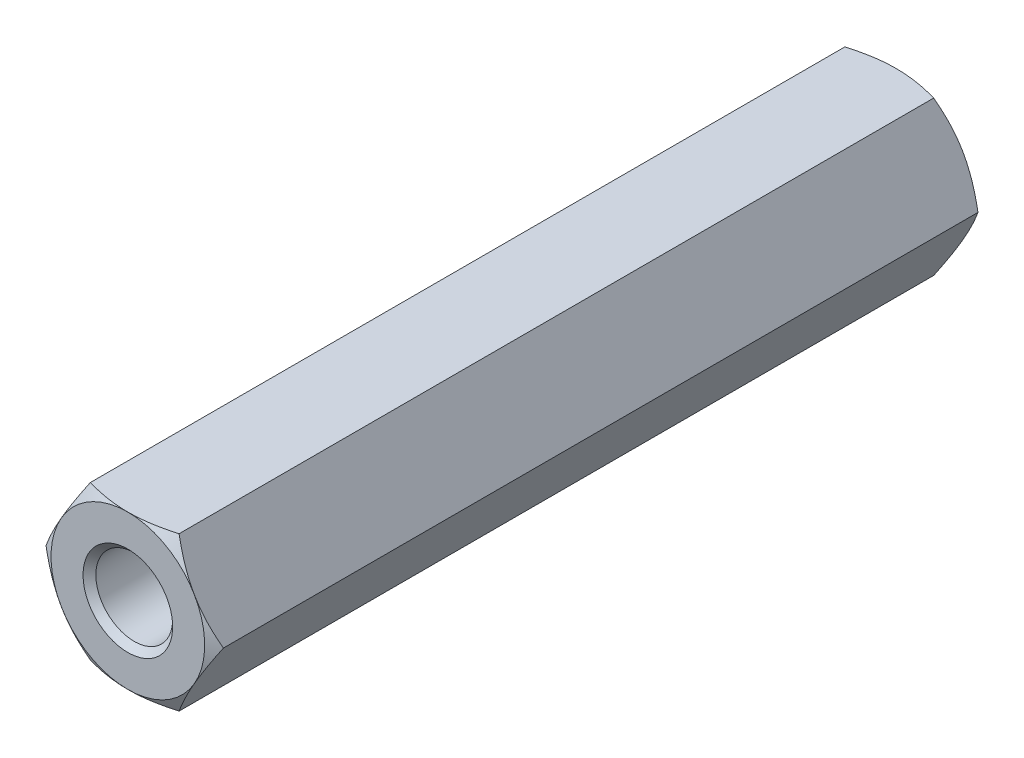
from build123d import *

# Parameters (mm, degrees)
BOSS_EXTRUDE1_DEPTH      = 15
SKETCH2_OUTSIDE_W        = 70.24
SKETCH2_OUTSIDE_H        = 69.312
SKETCH2_OUTSIDE_R        = 3
CUT_EXTRUDE1_DEPTH       = 16.684387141
CUT_EXTRUDE1_DRAFT       = -60
SKETCH3_R                = 1.5
SKETCH3_R_2              = 1.25
CUT_EXTRUDE2_DEPTH       = 10
SKETCH3_2_R              = 1.25
CUT_EXTRUDE3_DEPTH       = 10.75
CHAMFER1_SIZE            = 0.25
MIRROR1_COPY_1_SKETCH_W  = 70.24
MIRROR1_COPY_1_SKETCH_H  = 69.312
MIRROR1_COPY_1_SKETCH_R  = 3
MIRROR1_COPY_1_DEPTH     = 16.684387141
MIRROR1_COPY_1_DRAFT     = -60
CHAMFER1_OF_MIRROR1_SIZE = 0.25


with BuildPart() as part:
    # Sketch1 → Boss-Extrude1 (new body)
    with BuildSketch(Plane.XY):
        Polygon((1.732050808, 3), (-1.732050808, 3), (-3.464101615, 0), (-1.732050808, -3), (1.732050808, -3), (3.464101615, 0), align=None)
    boss_extrude1 = extrude(amount=-BOSS_EXTRUDE1_DEPTH)


with BuildPart() as cut_extrude1_tool:
    # Sketch2 outside → Cut-Extrude1 (with draft: the straight prism first)
    with BuildSketch(Plane(origin=(0, 0, -15), x_dir=(-1, 0, 0), z_dir=(0, 0, -1))):
        Rectangle(SKETCH2_OUTSIDE_W, SKETCH2_OUTSIDE_H)
        Circle(SKETCH2_OUTSIDE_R, mode=Mode.SUBTRACT)
    extrude(amount=-CUT_EXTRUDE1_DEPTH)
    # Cut-Extrude1: the draft: its side faces are tilted about the plane it starts from
    cut_extrude1_sides = [cut_extrude1_tool.faces().sort_by_distance(p)[0] for p in [
        (0, -34.656, -6.657806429),
        (-35.12, 0, -6.657806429),
        (0, 34.656, -6.657806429),
        (35.12, 0, -6.657806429),
        (3, 0, -6.657806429),
    ]]
    draft(cut_extrude1_sides, Plane(origin=(0, 0, -15), x_dir=(-1, 0, 0), z_dir=(0, 0, -1)), CUT_EXTRUDE1_DRAFT)


with BuildPart() as part_1:
    add(part.part)

    # Cut-Extrude1: cut by cut_extrude1_tool
    add(cut_extrude1_tool.part, mode=Mode.SUBTRACT)

    # Sketch3 → Cut-Extrude2 (cut)
    with BuildSketch(Plane(origin=(0, 0, -15), x_dir=(-1, 0, 0), z_dir=(0, 0, -1))):
        Circle(SKETCH3_R)
        Circle(SKETCH3_R_2, mode=Mode.SUBTRACT)
    cut_extrude2 = extrude(amount=-CUT_EXTRUDE2_DEPTH, mode=Mode.SUBTRACT)

    # Sketch3_2 → Cut-Extrude3 (cut)
    with BuildSketch(Plane(origin=(0, 0, -15), x_dir=(-1, 0, 0), z_dir=(0, 0, -1))):
        Circle(SKETCH3_2_R)
    cut_extrude3 = extrude(amount=-CUT_EXTRUDE3_DEPTH, mode=Mode.SUBTRACT)

    # Cut-Extrude4 cone 1 section (on through the dimple's axis) → Cut-Extrude4 (revolve, cut)
    with BuildSketch(Plane(origin=(0, 0, -4.25), x_dir=(0, 1, 0), z_dir=(1, 0, 0))):
        Polygon((0, 0), (1.25, 0), (0, 0.721687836), align=None)
    revolve(axis=Axis((0, 0, -4.25), (0, 0, 1)), mode=Mode.SUBTRACT)

    # Chamfer1
    chamfer1_edges = [part_1.edges().sort_by_distance(p)[0] for p in [
        (1.5, 0, -15),
    ]]
    chamfer(chamfer1_edges, length=CHAMFER1_SIZE)

    # Mirror1: Boss-Extrude1, Cut-Extrude2, Cut-Extrude3 across plane
    add(boss_extrude1.mirror(Plane.XY))
    add(cut_extrude2.mirror(Plane.XY), mode=Mode.SUBTRACT)
    add(cut_extrude3.mirror(Plane.XY), mode=Mode.SUBTRACT)


with BuildPart() as mirror1_copy_1_tool:
    # Mirror1 copy 1 sketch → Mirror1 copy 1 (with draft: the straight prism first)
    with BuildSketch(Plane(origin=(0, 0, 15), x_dir=(-1, 0, 0), z_dir=(0, 0, 1))):
        Rectangle(MIRROR1_COPY_1_SKETCH_W, MIRROR1_COPY_1_SKETCH_H)
        Circle(MIRROR1_COPY_1_SKETCH_R, mode=Mode.SUBTRACT)
    extrude(amount=-MIRROR1_COPY_1_DEPTH)
    # Mirror1 copy 1: the draft: its side faces are tilted about the plane it starts from
    mirror1_copy_1_sides = [mirror1_copy_1_tool.faces().sort_by_distance(p)[0] for p in [
        (0, -34.656, 6.657806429),
        (-35.12, 0, 6.657806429),
        (0, 34.656, 6.657806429),
        (35.12, 0, 6.657806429),
        (3, 0, 6.657806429),
    ]]
    draft(mirror1_copy_1_sides, Plane(origin=(0, 0, 15), x_dir=(-1, 0, 0), z_dir=(0, 0, 1)), MIRROR1_COPY_1_DRAFT)


with BuildPart() as part_2:
    add(part_1.part)

    # Mirror1 copy 1: cut by mirror1_copy_1_tool
    add(mirror1_copy_1_tool.part, mode=Mode.SUBTRACT)

    # Chamfer1 of Mirror1
    chamfer1_of_mirror1_edges = [part_2.edges().sort_by_distance(p)[0] for p in [
        (1.5, 0, 15),
    ]]
    chamfer(chamfer1_of_mirror1_edges, length=CHAMFER1_OF_MIRROR1_SIZE)


solid = part_2.part
